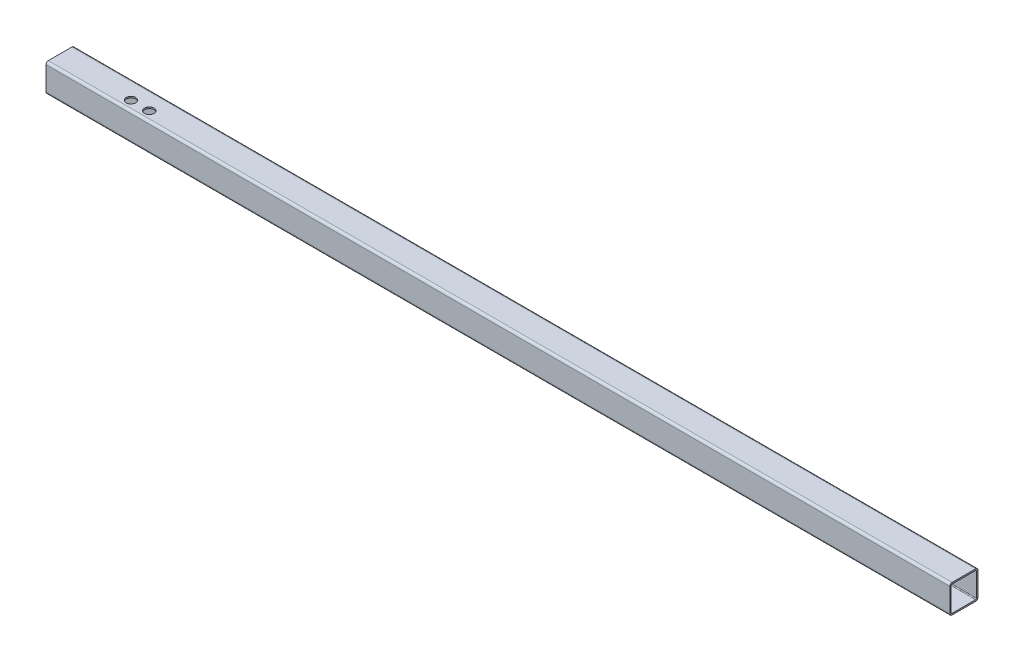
from build123d import *

# Parameters (mm, degrees)
BOSS_EXTRUDE1_DEPTH = 609.6
SCALE1_SCALE_X      = 1
SCALE1_SCALE_Y      = 0.6
SCALE1_SCALE_Z      = 0.6
SKETCH2_R           = 3.175
CUT_EXTRUDE1_DEPTH  = 2.54


with BuildPart() as part:
    # Sketch1 → Boss-Extrude1 (new body)
    with BuildSketch(Plane(origin=(0, 0, 0), x_dir=(0, 0, -1), z_dir=(1, 0, 0))):
        with BuildLine():
            Line((-0.186356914, 2.58389064), (-0.186356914, 29.16610936))
            ThreePointArc((-0.186356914, 29.16610936), (-0.94316096, 30.993195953), (-2.770247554, 31.75))
            Line((-2.770247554, 31.75), (-29.352466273, 31.75))
            ThreePointArc((-29.352466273, 31.75), (-31.179552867, 30.993195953), (-31.936356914, 29.16610936))
            Line((-31.936356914, 29.16610936), (-31.936356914, 2.58389064))
            ThreePointArc((-31.936356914, 2.58389064), (-31.179552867, 0.756804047), (-29.352466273, 0))
            Line((-29.352466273, 0), (-2.770247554, 0))
            ThreePointArc((-2.770247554, 0), (-0.94316096, 0.756804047), (-0.186356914, 2.58389064))
        make_face()
        with BuildLine():
            Line((-1.837356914, 2.54), (-1.837356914, 29.208455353))
            ThreePointArc((-1.837356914, 29.208455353), (-2.097737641, 29.838619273), (-2.727901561, 30.099))
            Line((-2.727901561, 30.099), (-29.396356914, 30.099))
            ThreePointArc((-29.396356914, 30.099), (-30.024974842, 29.838617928), (-30.285356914, 29.21))
            Line((-30.285356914, 29.21), (-30.285356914, 2.541544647))
            ThreePointArc((-30.285356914, 2.541544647), (-30.025521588, 1.911927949), (-29.396356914, 1.651))
            Line((-29.396356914, 1.651), (-2.727901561, 1.651))
            ThreePointArc((-2.727901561, 1.651), (-2.098284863, 1.910835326), (-1.837356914, 2.54))
        make_face(mode=Mode.SUBTRACT)
    extrude(amount=BOSS_EXTRUDE1_DEPTH)


with BuildPart() as part_1:
    # Scale1: scaled about (304.8, 15.875, 16.061357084)
    add(part.part.scale((SCALE1_SCALE_X, SCALE1_SCALE_Y, SCALE1_SCALE_Z), about=(304.8, 15.875, 16.061357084)))

    # Sketch2 → Cut-Extrude1 (cut)
    with BuildSketch(Plane(origin=(0, 25.4, 0), x_dir=(1, 0, 0), z_dir=(0, 1, 0))):
        with Locations(Location((50.950900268, -19.236356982, 0), (0, 0, 270))):
            Circle(SKETCH2_R)
        with Locations(Location((63.349099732, -19.236356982, 0), (0, 0, 270))):
            Circle(SKETCH2_R)
    extrude(amount=-CUT_EXTRUDE1_DEPTH, mode=Mode.SUBTRACT)


solid = part_1.part
